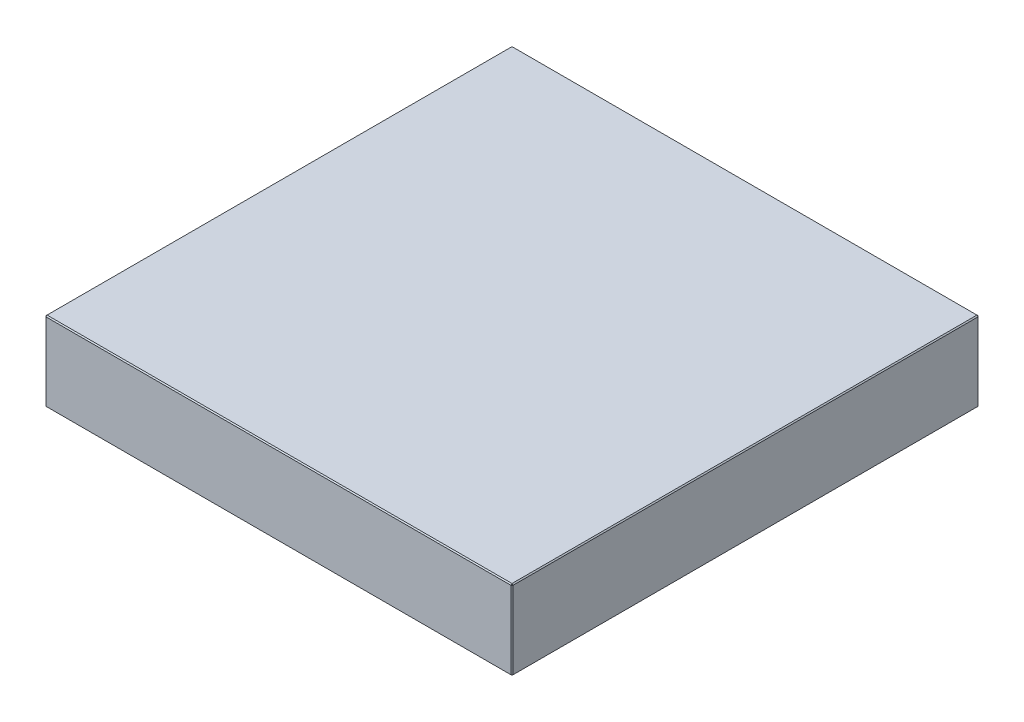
ISO-10303-21;
HEADER;
FILE_DESCRIPTION(('STEP AP214'),'2;1');
FILE_NAME('part.step','',(''),(''),'','','');
FILE_SCHEMA(('AUTOMOTIVE_DESIGN { 1 0 10303 214 1 1 1 1 }'));
ENDSEC;
DATA;
#1=APPLICATION_CONTEXT('core data for automotive mechanical design processes');
#2=APPLICATION_PROTOCOL_DEFINITION('international standard','automotive_design',2000,#1);
#3=PRODUCT_CONTEXT('',#1,'mechanical');
#4=PRODUCT('Part','Part','',(#3));
#5=PRODUCT_RELATED_PRODUCT_CATEGORY('part','',(#4));
#6=PRODUCT_DEFINITION_FORMATION('','',#4);
#7=PRODUCT_DEFINITION_CONTEXT('part definition',#1,'design');
#8=PRODUCT_DEFINITION('design','',#6,#7);
#9=PRODUCT_DEFINITION_SHAPE('','',#8);
#10=(LENGTH_UNIT() NAMED_UNIT(*) SI_UNIT(.MILLI.,.METRE.));
#11=(NAMED_UNIT(*) PLANE_ANGLE_UNIT() SI_UNIT($,.RADIAN.));
#12=(NAMED_UNIT(*) SI_UNIT($,.STERADIAN.) SOLID_ANGLE_UNIT());
#13=UNCERTAINTY_MEASURE_WITH_UNIT(LENGTH_MEASURE(1.E-05),#10,'distance_accuracy_value','');
#14=(GEOMETRIC_REPRESENTATION_CONTEXT(3) GLOBAL_UNCERTAINTY_ASSIGNED_CONTEXT((#13)) GLOBAL_UNIT_ASSIGNED_CONTEXT((#10,
#11,#12)) REPRESENTATION_CONTEXT('',''));
#15=CARTESIAN_POINT('',(0.,0.,0.));
#16=DIRECTION('',(0.,0.,1.));
#17=DIRECTION('',(1.,0.,0.));
#18=AXIS2_PLACEMENT_3D('',#15,#16,#17);
#19=CARTESIAN_POINT('',(-223.,76.,223.));
#20=DIRECTION('',(1.,0.,0.));
#21=DIRECTION('',(0.,0.,-1.));
#22=AXIS2_PLACEMENT_3D('',#19,#20,#21);
#23=PLANE('',#22);
#24=DIRECTION('',(0.,-1.,0.));
#25=VECTOR('',#24,1.);
#26=CARTESIAN_POINT('',(-223.,76.,-222.));
#27=LINE('',#26,#25);
#28=CARTESIAN_POINT('',(-223.,75.,-222.));
#29=VERTEX_POINT('',#28);
#30=CARTESIAN_POINT('',(-223.,1.,-222.));
#31=VERTEX_POINT('',#30);
#32=EDGE_CURVE('E114',#29,#31,#27,.T.);
#33=ORIENTED_EDGE('',*,*,#32,.T.);
#34=DIRECTION('',(0.,0.,1.));
#35=VECTOR('',#34,1.);
#36=CARTESIAN_POINT('',(-223.,1.,223.));
#37=LINE('',#36,#35);
#38=CARTESIAN_POINT('',(-223.,1.,222.));
#39=VERTEX_POINT('',#38);
#40=EDGE_CURVE('E110',#31,#39,#37,.T.);
#41=ORIENTED_EDGE('',*,*,#40,.T.);
#42=DIRECTION('',(0.,1.,0.));
#43=VECTOR('',#42,1.);
#44=CARTESIAN_POINT('',(-223.,76.,222.));
#45=LINE('',#44,#43);
#46=CARTESIAN_POINT('',(-223.,75.,222.));
#47=VERTEX_POINT('',#46);
#48=EDGE_CURVE('E103',#39,#47,#45,.T.);
#49=ORIENTED_EDGE('',*,*,#48,.T.);
#50=DIRECTION('',(0.,0.,-1.));
#51=VECTOR('',#50,1.);
#52=CARTESIAN_POINT('',(-223.,75.,-223.));
#53=LINE('',#52,#51);
#54=EDGE_CURVE('E107',#47,#29,#53,.T.);
#55=ORIENTED_EDGE('',*,*,#54,.T.);
#56=EDGE_LOOP('',(#33,#41,#49,#55));
#57=FACE_BOUND('',#56,.T.);
#58=ADVANCED_FACE('F15',(#57),#23,.F.);
#59=CARTESIAN_POINT('',(223.,76.,223.));
#60=DIRECTION('',(0.,0.,-1.));
#61=DIRECTION('',(-1.,0.,0.));
#62=AXIS2_PLACEMENT_3D('',#59,#60,#61);
#63=PLANE('',#62);
#64=DIRECTION('',(-1.,0.,0.));
#65=VECTOR('',#64,1.);
#66=CARTESIAN_POINT('',(-223.,75.,223.));
#67=LINE('',#66,#65);
#68=CARTESIAN_POINT('',(222.,75.,223.));
#69=VERTEX_POINT('',#68);
#70=CARTESIAN_POINT('',(-222.,75.,223.));
#71=VERTEX_POINT('',#70);
#72=EDGE_CURVE('E164',#69,#71,#67,.T.);
#73=ORIENTED_EDGE('',*,*,#72,.T.);
#74=DIRECTION('',(0.,-1.,0.));
#75=VECTOR('',#74,1.);
#76=CARTESIAN_POINT('',(-222.,76.,223.));
#77=LINE('',#76,#75);
#78=CARTESIAN_POINT('',(-222.,1.00000000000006,223.));
#79=VERTEX_POINT('',#78);
#80=EDGE_CURVE('E122',#71,#79,#77,.T.);
#81=ORIENTED_EDGE('',*,*,#80,.T.);
#82=DIRECTION('',(1.,0.,0.));
#83=VECTOR('',#82,1.);
#84=CARTESIAN_POINT('',(223.,1.00000000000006,223.));
#85=LINE('',#84,#83);
#86=CARTESIAN_POINT('',(222.,1.00000000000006,223.));
#87=VERTEX_POINT('',#86);
#88=EDGE_CURVE('E168',#79,#87,#85,.T.);
#89=ORIENTED_EDGE('',*,*,#88,.T.);
#90=DIRECTION('',(0.,1.,0.));
#91=VECTOR('',#90,1.);
#92=CARTESIAN_POINT('',(222.,76.,223.));
#93=LINE('',#92,#91);
#94=EDGE_CURVE('E166',#87,#69,#93,.T.);
#95=ORIENTED_EDGE('',*,*,#94,.T.);
#96=EDGE_LOOP('',(#73,#81,#89,#95));
#97=FACE_BOUND('',#96,.T.);
#98=ADVANCED_FACE('F275',(#97),#63,.F.);
#99=CARTESIAN_POINT('',(223.,76.,223.));
#100=DIRECTION('',(-1.,0.,0.));
#101=DIRECTION('',(0.,0.,1.));
#102=AXIS2_PLACEMENT_3D('',#99,#100,#101);
#103=PLANE('',#102);
#104=DIRECTION('',(0.,0.,-1.));
#105=VECTOR('',#104,1.);
#106=CARTESIAN_POINT('',(223.,1.00000000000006,223.));
#107=LINE('',#106,#105);
#108=CARTESIAN_POINT('',(223.,1.00000000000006,222.));
#109=VERTEX_POINT('',#108);
#110=CARTESIAN_POINT('',(223.,1.00000000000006,-222.));
#111=VERTEX_POINT('',#110);
#112=EDGE_CURVE('E159',#109,#111,#107,.T.);
#113=ORIENTED_EDGE('',*,*,#112,.T.);
#114=DIRECTION('',(0.,1.,0.));
#115=VECTOR('',#114,1.);
#116=CARTESIAN_POINT('',(223.,76.,-222.));
#117=LINE('',#116,#115);
#118=CARTESIAN_POINT('',(223.,75.,-222.));
#119=VERTEX_POINT('',#118);
#120=EDGE_CURVE('E161',#111,#119,#117,.T.);
#121=ORIENTED_EDGE('',*,*,#120,.T.);
#122=DIRECTION('',(0.,0.,1.));
#123=VECTOR('',#122,1.);
#124=CARTESIAN_POINT('',(223.,75.,223.));
#125=LINE('',#124,#123);
#126=CARTESIAN_POINT('',(223.,75.,222.));
#127=VERTEX_POINT('',#126);
#128=EDGE_CURVE('E155',#119,#127,#125,.T.);
#129=ORIENTED_EDGE('',*,*,#128,.T.);
#130=DIRECTION('',(0.,-1.,0.));
#131=VECTOR('',#130,1.);
#132=CARTESIAN_POINT('',(223.,76.,222.));
#133=LINE('',#132,#131);
#134=EDGE_CURVE('E157',#127,#109,#133,.T.);
#135=ORIENTED_EDGE('',*,*,#134,.T.);
#136=EDGE_LOOP('',(#113,#121,#129,#135));
#137=FACE_BOUND('',#136,.T.);
#138=ADVANCED_FACE('F254',(#137),#103,.F.);
#139=CARTESIAN_POINT('',(223.,76.,-223.));
#140=DIRECTION('',(0.,0.,1.));
#141=DIRECTION('',(1.,0.,0.));
#142=AXIS2_PLACEMENT_3D('',#139,#140,#141);
#143=PLANE('',#142);
#144=DIRECTION('',(0.,-1.,0.));
#145=VECTOR('',#144,1.);
#146=CARTESIAN_POINT('',(222.,76.,-223.));
#147=LINE('',#146,#145);
#148=CARTESIAN_POINT('',(222.,75.,-223.));
#149=VERTEX_POINT('',#148);
#150=CARTESIAN_POINT('',(222.,1.00000000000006,-223.));
#151=VERTEX_POINT('',#150);
#152=EDGE_CURVE('E148',#149,#151,#147,.T.);
#153=ORIENTED_EDGE('',*,*,#152,.T.);
#154=DIRECTION('',(-1.,0.,0.));
#155=VECTOR('',#154,1.);
#156=CARTESIAN_POINT('',(223.,1.00000000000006,-223.));
#157=LINE('',#156,#155);
#158=CARTESIAN_POINT('',(-222.,1.00000000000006,-223.));
#159=VERTEX_POINT('',#158);
#160=EDGE_CURVE('E153',#151,#159,#157,.T.);
#161=ORIENTED_EDGE('',*,*,#160,.T.);
#162=DIRECTION('',(0.,1.,0.));
#163=VECTOR('',#162,1.);
#164=CARTESIAN_POINT('',(-222.,76.,-223.));
#165=LINE('',#164,#163);
#166=CARTESIAN_POINT('',(-222.,75.,-223.));
#167=VERTEX_POINT('',#166);
#168=EDGE_CURVE('E150',#159,#167,#165,.T.);
#169=ORIENTED_EDGE('',*,*,#168,.T.);
#170=DIRECTION('',(1.,0.,0.));
#171=VECTOR('',#170,1.);
#172=CARTESIAN_POINT('',(223.,75.,-223.));
#173=LINE('',#172,#171);
#174=EDGE_CURVE('E146',#167,#149,#173,.T.);
#175=ORIENTED_EDGE('',*,*,#174,.T.);
#176=EDGE_LOOP('',(#153,#161,#169,#175));
#177=FACE_BOUND('',#176,.T.);
#178=ADVANCED_FACE('F284',(#177),#143,.F.);
#179=CARTESIAN_POINT('',(0.,76.,0.));
#180=DIRECTION('',(0.,1.,0.));
#181=DIRECTION('',(0.,0.,1.));
#182=AXIS2_PLACEMENT_3D('',#179,#180,#181);
#183=PLANE('',#182);
#184=DIRECTION('',(0.,0.,-1.));
#185=VECTOR('',#184,1.);
#186=CARTESIAN_POINT('',(222.,76.,-223.));
#187=LINE('',#186,#185);
#188=CARTESIAN_POINT('',(222.,76.,222.));
#189=VERTEX_POINT('',#188);
#190=CARTESIAN_POINT('',(222.,76.,-222.));
#191=VERTEX_POINT('',#190);
#192=EDGE_CURVE('E24',#189,#191,#187,.T.);
#193=ORIENTED_EDGE('',*,*,#192,.T.);
#194=DIRECTION('',(-1.,0.,0.));
#195=VECTOR('',#194,1.);
#196=CARTESIAN_POINT('',(-223.,76.,-222.));
#197=LINE('',#196,#195);
#198=CARTESIAN_POINT('',(-222.,76.,-222.));
#199=VERTEX_POINT('',#198);
#200=EDGE_CURVE('E9',#191,#199,#197,.T.);
#201=ORIENTED_EDGE('',*,*,#200,.T.);
#202=DIRECTION('',(0.,0.,1.));
#203=VECTOR('',#202,1.);
#204=CARTESIAN_POINT('',(-222.,76.,223.));
#205=LINE('',#204,#203);
#206=CARTESIAN_POINT('',(-222.,76.,222.));
#207=VERTEX_POINT('',#206);
#208=EDGE_CURVE('E180',#199,#207,#205,.T.);
#209=ORIENTED_EDGE('',*,*,#208,.T.);
#210=DIRECTION('',(1.,0.,0.));
#211=VECTOR('',#210,1.);
#212=CARTESIAN_POINT('',(223.,76.,222.));
#213=LINE('',#212,#211);
#214=EDGE_CURVE('E35',#207,#189,#213,.T.);
#215=ORIENTED_EDGE('',*,*,#214,.T.);
#216=EDGE_LOOP('',(#193,#201,#209,#215));
#217=FACE_BOUND('',#216,.T.);
#218=ADVANCED_FACE('F350',(#217),#183,.T.);
#219=CARTESIAN_POINT('',(0.,0.,0.));
#220=DIRECTION('',(0.,1.,0.));
#221=DIRECTION('',(0.,0.,1.));
#222=AXIS2_PLACEMENT_3D('',#219,#220,#221);
#223=PLANE('',#222);
#224=DIRECTION('',(0.,0.,1.));
#225=VECTOR('',#224,1.);
#226=CARTESIAN_POINT('',(222.,0.,0.));
#227=LINE('',#226,#225);
#228=CARTESIAN_POINT('',(222.,0.,-222.));
#229=VERTEX_POINT('',#228);
#230=CARTESIAN_POINT('',(222.,0.,222.));
#231=VERTEX_POINT('',#230);
#232=EDGE_CURVE('E171',#229,#231,#227,.T.);
#233=ORIENTED_EDGE('',*,*,#232,.T.);
#234=DIRECTION('',(-1.,0.,0.));
#235=VECTOR('',#234,1.);
#236=CARTESIAN_POINT('',(0.,0.,222.));
#237=LINE('',#236,#235);
#238=CARTESIAN_POINT('',(-222.,0.,222.));
#239=VERTEX_POINT('',#238);
#240=EDGE_CURVE('E177',#231,#239,#237,.T.);
#241=ORIENTED_EDGE('',*,*,#240,.T.);
#242=DIRECTION('',(0.,0.,-1.));
#243=VECTOR('',#242,1.);
#244=CARTESIAN_POINT('',(-222.,0.,0.));
#245=LINE('',#244,#243);
#246=CARTESIAN_POINT('',(-222.,0.,-222.));
#247=VERTEX_POINT('',#246);
#248=EDGE_CURVE('E175',#239,#247,#245,.T.);
#249=ORIENTED_EDGE('',*,*,#248,.T.);
#250=DIRECTION('',(1.,0.,0.));
#251=VECTOR('',#250,1.);
#252=CARTESIAN_POINT('',(0.,0.,-222.));
#253=LINE('',#252,#251);
#254=EDGE_CURVE('E173',#247,#229,#253,.T.);
#255=ORIENTED_EDGE('',*,*,#254,.T.);
#256=EDGE_LOOP('',(#233,#241,#249,#255));
#257=FACE_BOUND('',#256,.T.);
#258=ADVANCED_FACE('F246',(#257),#223,.F.);
#259=CARTESIAN_POINT('',(223.,76.,222.));
#260=DIRECTION('',(-0.707106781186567,0.,-0.707106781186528));
#261=DIRECTION('',(0.,-1.,0.));
#262=AXIS2_PLACEMENT_3D('',#259,#260,#261);
#263=PLANE('',#262);
#264=DIRECTION('',(-0.707106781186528,0.,0.707106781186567));
#265=VECTOR('',#264,1.);
#266=CARTESIAN_POINT('',(222.,75.,223.));
#267=LINE('',#266,#265);
#268=EDGE_CURVE('E19',#69,#127,#267,.F.);
#269=ORIENTED_EDGE('',*,*,#268,.F.);
#270=ORIENTED_EDGE('',*,*,#94,.F.);
#271=DIRECTION('',(0.707106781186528,0.,-0.707106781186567));
#272=VECTOR('',#271,1.);
#273=CARTESIAN_POINT('',(222.,1.00000000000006,223.));
#274=LINE('',#273,#272);
#275=EDGE_CURVE('E142',#109,#87,#274,.F.);
#276=ORIENTED_EDGE('',*,*,#275,.F.);
#277=ORIENTED_EDGE('',*,*,#134,.F.);
#278=EDGE_LOOP('',(#269,#270,#276,#277));
#279=FACE_BOUND('',#278,.T.);
#280=ADVANCED_FACE('F17',(#279),#263,.F.);
#281=CARTESIAN_POINT('',(222.,75.,223.));
#282=DIRECTION('',(0.577350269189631,0.577350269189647,0.577350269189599));
#283=DIRECTION('',(-0.707106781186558,0.707106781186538,0.));
#284=AXIS2_PLACEMENT_3D('',#281,#282,#283);
#285=PLANE('',#284);
#286=DIRECTION('',(0.,-0.707106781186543,0.707106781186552));
#287=VECTOR('',#286,1.);
#288=CARTESIAN_POINT('',(222.,75.,223.));
#289=LINE('',#288,#287);
#290=EDGE_CURVE('E226',#69,#189,#289,.F.);
#291=ORIENTED_EDGE('',*,*,#290,.F.);
#292=ORIENTED_EDGE('',*,*,#268,.T.);
#293=DIRECTION('',(-0.707106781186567,0.707106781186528,0.));
#294=VECTOR('',#293,1.);
#295=CARTESIAN_POINT('',(222.5,75.5,222.));
#296=LINE('',#295,#294);
#297=EDGE_CURVE('E228',#189,#127,#296,.F.);
#298=ORIENTED_EDGE('',*,*,#297,.F.);
#299=EDGE_LOOP('',(#291,#292,#298));
#300=FACE_BOUND('',#299,.T.);
#301=ADVANCED_FACE('F270',(#300),#285,.T.);
#302=CARTESIAN_POINT('',(222.,1.00000000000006,223.));
#303=DIRECTION('',(0.577350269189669,-0.577350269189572,0.577350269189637));
#304=DIRECTION('',(0.707106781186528,0.,-0.707106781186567));
#305=AXIS2_PLACEMENT_3D('',#302,#303,#304);
#306=PLANE('',#305);
#307=DIRECTION('',(-0.707106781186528,-0.707106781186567,0.));
#308=VECTOR('',#307,1.);
#309=CARTESIAN_POINT('',(222.5,0.5,222.));
#310=LINE('',#309,#308);
#311=EDGE_CURVE('E220',#109,#231,#310,.T.);
#312=ORIENTED_EDGE('',*,*,#311,.F.);
#313=ORIENTED_EDGE('',*,*,#275,.T.);
#314=DIRECTION('',(0.,0.707106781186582,0.707106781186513));
#315=VECTOR('',#314,1.);
#316=CARTESIAN_POINT('',(222.,1.00000000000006,223.));
#317=LINE('',#316,#315);
#318=EDGE_CURVE('E223',#231,#87,#317,.T.);
#319=ORIENTED_EDGE('',*,*,#318,.F.);
#320=EDGE_LOOP('',(#312,#313,#319));
#321=FACE_BOUND('',#320,.T.);
#322=ADVANCED_FACE('F235',(#321),#306,.T.);
#323=CARTESIAN_POINT('',(222.,76.,0.));
#324=DIRECTION('',(0.707106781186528,0.707106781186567,0.));
#325=DIRECTION('',(0.,0.,1.));
#326=AXIS2_PLACEMENT_3D('',#323,#324,#325);
#327=PLANE('',#326);
#328=ORIENTED_EDGE('',*,*,#297,.T.);
#329=ORIENTED_EDGE('',*,*,#128,.F.);
#330=DIRECTION('',(0.707106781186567,-0.707106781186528,0.));
#331=VECTOR('',#330,1.);
#332=CARTESIAN_POINT('',(223.,75.,-222.));
#333=LINE('',#332,#331);
#334=EDGE_CURVE('E215',#191,#119,#333,.T.);
#335=ORIENTED_EDGE('',*,*,#334,.F.);
#336=ORIENTED_EDGE('',*,*,#192,.F.);
#337=EDGE_LOOP('',(#328,#329,#335,#336));
#338=FACE_BOUND('',#337,.T.);
#339=ADVANCED_FACE('F265',(#338),#327,.T.);
#340=CARTESIAN_POINT('',(0.,76.,222.));
#341=DIRECTION('',(0.,0.707106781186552,0.707106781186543));
#342=DIRECTION('',(-1.,0.,0.));
#343=AXIS2_PLACEMENT_3D('',#340,#341,#342);
#344=PLANE('',#343);
#345=ORIENTED_EDGE('',*,*,#290,.T.);
#346=ORIENTED_EDGE('',*,*,#214,.F.);
#347=DIRECTION('',(0.,0.707106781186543,-0.707106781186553));
#348=VECTOR('',#347,1.);
#349=CARTESIAN_POINT('',(-222.,75.5,222.5));
#350=LINE('',#349,#348);
#351=EDGE_CURVE('E126',#71,#207,#350,.T.);
#352=ORIENTED_EDGE('',*,*,#351,.F.);
#353=ORIENTED_EDGE('',*,*,#72,.F.);
#354=EDGE_LOOP('',(#345,#346,#352,#353));
#355=FACE_BOUND('',#354,.T.);
#356=ADVANCED_FACE('F273',(#355),#344,.T.);
#357=CARTESIAN_POINT('',(-222.,76.,223.));
#358=DIRECTION('',(0.707106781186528,0.,-0.707106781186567));
#359=DIRECTION('',(0.,-1.,0.));
#360=AXIS2_PLACEMENT_3D('',#357,#358,#359);
#361=PLANE('',#360);
#362=DIRECTION('',(0.707106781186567,0.,0.707106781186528));
#363=VECTOR('',#362,1.);
#364=CARTESIAN_POINT('',(-222.,1.00000000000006,223.));
#365=LINE('',#364,#363);
#366=EDGE_CURVE('E127',#79,#39,#365,.F.);
#367=ORIENTED_EDGE('',*,*,#366,.F.);
#368=ORIENTED_EDGE('',*,*,#80,.F.);
#369=DIRECTION('',(-0.707106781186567,0.,-0.707106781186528));
#370=VECTOR('',#369,1.);
#371=CARTESIAN_POINT('',(-223.,75.,222.));
#372=LINE('',#371,#370);
#373=EDGE_CURVE('E118',#47,#71,#372,.F.);
#374=ORIENTED_EDGE('',*,*,#373,.F.);
#375=ORIENTED_EDGE('',*,*,#48,.F.);
#376=EDGE_LOOP('',(#367,#368,#374,#375));
#377=FACE_BOUND('',#376,.T.);
#378=ADVANCED_FACE('F120',(#377),#361,.F.);
#379=CARTESIAN_POINT('',(223.,1.00000000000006,223.));
#380=DIRECTION('',(0.,0.707106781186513,-0.707106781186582));
#381=DIRECTION('',(1.,0.,0.));
#382=AXIS2_PLACEMENT_3D('',#379,#380,#381);
#383=PLANE('',#382);
#384=ORIENTED_EDGE('',*,*,#318,.T.);
#385=ORIENTED_EDGE('',*,*,#88,.F.);
#386=DIRECTION('',(0.,-0.707106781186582,-0.707106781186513));
#387=VECTOR('',#386,1.);
#388=CARTESIAN_POINT('',(-222.,1.00000000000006,223.));
#389=LINE('',#388,#387);
#390=EDGE_CURVE('E211',#239,#79,#389,.F.);
#391=ORIENTED_EDGE('',*,*,#390,.F.);
#392=ORIENTED_EDGE('',*,*,#240,.F.);
#393=EDGE_LOOP('',(#384,#385,#391,#392));
#394=FACE_BOUND('',#393,.T.);
#395=ADVANCED_FACE('F243',(#394),#383,.F.);
#396=CARTESIAN_POINT('',(223.,1.00000000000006,223.));
#397=DIRECTION('',(-0.707106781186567,0.707106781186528,0.));
#398=DIRECTION('',(0.,0.,-1.));
#399=AXIS2_PLACEMENT_3D('',#396,#397,#398);
#400=PLANE('',#399);
#401=ORIENTED_EDGE('',*,*,#311,.T.);
#402=ORIENTED_EDGE('',*,*,#232,.F.);
#403=DIRECTION('',(0.707106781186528,0.707106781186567,0.));
#404=VECTOR('',#403,1.);
#405=CARTESIAN_POINT('',(222.5,0.500000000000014,-222.));
#406=LINE('',#405,#404);
#407=EDGE_CURVE('E208',#111,#229,#406,.F.);
#408=ORIENTED_EDGE('',*,*,#407,.F.);
#409=ORIENTED_EDGE('',*,*,#112,.F.);
#410=EDGE_LOOP('',(#401,#402,#408,#409));
#411=FACE_BOUND('',#410,.T.);
#412=ADVANCED_FACE('F251',(#411),#400,.F.);
#413=CARTESIAN_POINT('',(222.,76.,-223.));
#414=DIRECTION('',(-0.707106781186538,0.,0.707106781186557));
#415=DIRECTION('',(0.,-1.,0.));
#416=AXIS2_PLACEMENT_3D('',#413,#414,#415);
#417=PLANE('',#416);
#418=DIRECTION('',(0.707106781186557,0.,0.707106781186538));
#419=VECTOR('',#418,1.);
#420=CARTESIAN_POINT('',(223.,75.,-222.));
#421=LINE('',#420,#419);
#422=EDGE_CURVE('E217',#119,#149,#421,.F.);
#423=ORIENTED_EDGE('',*,*,#422,.F.);
#424=ORIENTED_EDGE('',*,*,#120,.F.);
#425=DIRECTION('',(-0.707106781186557,0.,-0.707106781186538));
#426=VECTOR('',#425,1.);
#427=CARTESIAN_POINT('',(222.,1.00000000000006,-223.));
#428=LINE('',#427,#426);
#429=EDGE_CURVE('E205',#151,#111,#428,.F.);
#430=ORIENTED_EDGE('',*,*,#429,.F.);
#431=ORIENTED_EDGE('',*,*,#152,.F.);
#432=EDGE_LOOP('',(#423,#424,#430,#431));
#433=FACE_BOUND('',#432,.T.);
#434=ADVANCED_FACE('F258',(#433),#417,.F.);
#435=CARTESIAN_POINT('',(223.,75.,-222.));
#436=DIRECTION('',(0.577350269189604,0.577350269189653,-0.57735026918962));
#437=DIRECTION('',(0.,0.707106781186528,0.707106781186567));
#438=AXIS2_PLACEMENT_3D('',#435,#436,#437);
#439=PLANE('',#438);
#440=ORIENTED_EDGE('',*,*,#334,.T.);
#441=ORIENTED_EDGE('',*,*,#422,.T.);
#442=DIRECTION('',(0.,0.707106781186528,0.707106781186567));
#443=VECTOR('',#442,1.);
#444=CARTESIAN_POINT('',(222.,75.5,-222.5));
#445=LINE('',#444,#443);
#446=EDGE_CURVE('E134',#191,#149,#445,.F.);
#447=ORIENTED_EDGE('',*,*,#446,.F.);
#448=EDGE_LOOP('',(#440,#441,#447));
#449=FACE_BOUND('',#448,.T.);
#450=ADVANCED_FACE('F325',(#449),#439,.T.);
#451=CARTESIAN_POINT('',(-223.,75.,222.));
#452=DIRECTION('',(-0.577350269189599,0.577350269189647,0.577350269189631));
#453=DIRECTION('',(0.,-0.707106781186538,0.707106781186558));
#454=AXIS2_PLACEMENT_3D('',#451,#452,#453);
#455=PLANE('',#454);
#456=ORIENTED_EDGE('',*,*,#373,.T.);
#457=ORIENTED_EDGE('',*,*,#351,.T.);
#458=DIRECTION('',(-0.707106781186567,-0.707106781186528,0.));
#459=VECTOR('',#458,1.);
#460=CARTESIAN_POINT('',(-223.,75.,222.));
#461=LINE('',#460,#459);
#462=EDGE_CURVE('E130',#47,#207,#461,.F.);
#463=ORIENTED_EDGE('',*,*,#462,.F.);
#464=EDGE_LOOP('',(#456,#457,#463));
#465=FACE_BOUND('',#464,.T.);
#466=ADVANCED_FACE('F131',(#465),#455,.T.);
#467=CARTESIAN_POINT('',(-222.,1.00000000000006,223.));
#468=DIRECTION('',(-0.577350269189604,-0.577350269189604,0.577350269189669));
#469=DIRECTION('',(0.707106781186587,0.,0.707106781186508));
#470=AXIS2_PLACEMENT_3D('',#467,#468,#469);
#471=PLANE('',#470);
#472=ORIENTED_EDGE('',*,*,#390,.T.);
#473=ORIENTED_EDGE('',*,*,#366,.T.);
#474=DIRECTION('',(-0.707106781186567,0.707106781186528,0.));
#475=VECTOR('',#474,1.);
#476=CARTESIAN_POINT('',(-222.5,0.499999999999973,222.));
#477=LINE('',#476,#475);
#478=EDGE_CURVE('E135',#239,#39,#477,.T.);
#479=ORIENTED_EDGE('',*,*,#478,.F.);
#480=EDGE_LOOP('',(#472,#473,#479));
#481=FACE_BOUND('',#480,.T.);
#482=ADVANCED_FACE('F318',(#481),#471,.T.);
#483=CARTESIAN_POINT('',(222.,1.00000000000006,-223.));
#484=DIRECTION('',(0.577350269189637,-0.577350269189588,-0.577350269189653));
#485=DIRECTION('',(-0.707106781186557,0.,-0.707106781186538));
#486=AXIS2_PLACEMENT_3D('',#483,#484,#485);
#487=PLANE('',#486);
#488=ORIENTED_EDGE('',*,*,#429,.T.);
#489=ORIENTED_EDGE('',*,*,#407,.T.);
#490=DIRECTION('',(0.,-0.707106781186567,0.707106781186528));
#491=VECTOR('',#490,1.);
#492=CARTESIAN_POINT('',(222.,1.00000000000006,-223.));
#493=LINE('',#492,#491);
#494=EDGE_CURVE('E198',#151,#229,#493,.T.);
#495=ORIENTED_EDGE('',*,*,#494,.F.);
#496=EDGE_LOOP('',(#488,#489,#495));
#497=FACE_BOUND('',#496,.T.);
#498=ADVANCED_FACE('F314',(#497),#487,.T.);
#499=CARTESIAN_POINT('',(0.,76.,-222.));
#500=DIRECTION('',(0.,0.707106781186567,-0.707106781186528));
#501=DIRECTION('',(1.,0.,0.));
#502=AXIS2_PLACEMENT_3D('',#499,#500,#501);
#503=PLANE('',#502);
#504=ORIENTED_EDGE('',*,*,#446,.T.);
#505=ORIENTED_EDGE('',*,*,#174,.F.);
#506=DIRECTION('',(0.,-0.707106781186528,-0.707106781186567));
#507=VECTOR('',#506,1.);
#508=CARTESIAN_POINT('',(-222.,75.,-223.));
#509=LINE('',#508,#507);
#510=EDGE_CURVE('E195',#199,#167,#509,.T.);
#511=ORIENTED_EDGE('',*,*,#510,.F.);
#512=ORIENTED_EDGE('',*,*,#200,.F.);
#513=EDGE_LOOP('',(#504,#505,#511,#512));
#514=FACE_BOUND('',#513,.T.);
#515=ADVANCED_FACE('F311',(#514),#503,.T.);
#516=CARTESIAN_POINT('',(-222.,76.,0.));
#517=DIRECTION('',(-0.707106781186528,0.707106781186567,0.));
#518=DIRECTION('',(0.,0.,-1.));
#519=AXIS2_PLACEMENT_3D('',#516,#517,#518);
#520=PLANE('',#519);
#521=ORIENTED_EDGE('',*,*,#462,.T.);
#522=ORIENTED_EDGE('',*,*,#208,.F.);
#523=DIRECTION('',(0.707106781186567,0.707106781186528,0.));
#524=VECTOR('',#523,1.);
#525=CARTESIAN_POINT('',(-222.5,75.5,-222.));
#526=LINE('',#525,#524);
#527=EDGE_CURVE('E138',#29,#199,#526,.T.);
#528=ORIENTED_EDGE('',*,*,#527,.F.);
#529=ORIENTED_EDGE('',*,*,#54,.F.);
#530=EDGE_LOOP('',(#521,#522,#528,#529));
#531=FACE_BOUND('',#530,.T.);
#532=ADVANCED_FACE('F137',(#531),#520,.T.);
#533=CARTESIAN_POINT('',(-223.,1.,223.));
#534=DIRECTION('',(0.707106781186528,0.707106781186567,0.));
#535=DIRECTION('',(0.,0.,1.));
#536=AXIS2_PLACEMENT_3D('',#533,#534,#535);
#537=PLANE('',#536);
#538=ORIENTED_EDGE('',*,*,#478,.T.);
#539=ORIENTED_EDGE('',*,*,#40,.F.);
#540=DIRECTION('',(0.707106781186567,-0.707106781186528,0.));
#541=VECTOR('',#540,1.);
#542=CARTESIAN_POINT('',(-223.,1.,-222.));
#543=LINE('',#542,#541);
#544=EDGE_CURVE('E191',#247,#31,#543,.F.);
#545=ORIENTED_EDGE('',*,*,#544,.F.);
#546=ORIENTED_EDGE('',*,*,#248,.F.);
#547=EDGE_LOOP('',(#538,#539,#545,#546));
#548=FACE_BOUND('',#547,.T.);
#549=ADVANCED_FACE('F304',(#548),#537,.F.);
#550=CARTESIAN_POINT('',(223.,1.00000000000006,-223.));
#551=DIRECTION('',(0.,0.707106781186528,0.707106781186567));
#552=DIRECTION('',(-1.,0.,0.));
#553=AXIS2_PLACEMENT_3D('',#550,#551,#552);
#554=PLANE('',#553);
#555=ORIENTED_EDGE('',*,*,#494,.T.);
#556=ORIENTED_EDGE('',*,*,#254,.F.);
#557=DIRECTION('',(0.,0.707106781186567,-0.707106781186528));
#558=VECTOR('',#557,1.);
#559=CARTESIAN_POINT('',(-222.,0.500000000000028,-222.5));
#560=LINE('',#559,#558);
#561=EDGE_CURVE('E188',#159,#247,#560,.F.);
#562=ORIENTED_EDGE('',*,*,#561,.F.);
#563=ORIENTED_EDGE('',*,*,#160,.F.);
#564=EDGE_LOOP('',(#555,#556,#562,#563));
#565=FACE_BOUND('',#564,.T.);
#566=ADVANCED_FACE('F300',(#565),#554,.F.);
#567=CARTESIAN_POINT('',(-222.,75.,-223.));
#568=DIRECTION('',(-0.577350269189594,0.577350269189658,-0.577350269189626));
#569=DIRECTION('',(0.,0.707106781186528,0.707106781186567));
#570=AXIS2_PLACEMENT_3D('',#567,#568,#569);
#571=PLANE('',#570);
#572=ORIENTED_EDGE('',*,*,#527,.T.);
#573=ORIENTED_EDGE('',*,*,#510,.T.);
#574=DIRECTION('',(0.707106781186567,0.,-0.707106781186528));
#575=VECTOR('',#574,1.);
#576=CARTESIAN_POINT('',(-222.,75.,-223.));
#577=LINE('',#576,#575);
#578=EDGE_CURVE('E186',#29,#167,#577,.T.);
#579=ORIENTED_EDGE('',*,*,#578,.F.);
#580=EDGE_LOOP('',(#572,#573,#579));
#581=FACE_BOUND('',#580,.T.);
#582=ADVANCED_FACE('F296',(#581),#571,.T.);
#583=CARTESIAN_POINT('',(-223.,1.,-222.));
#584=DIRECTION('',(-0.577350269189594,-0.577350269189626,-0.577350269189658));
#585=DIRECTION('',(0.,0.707106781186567,-0.707106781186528));
#586=AXIS2_PLACEMENT_3D('',#583,#584,#585);
#587=PLANE('',#586);
#588=ORIENTED_EDGE('',*,*,#561,.T.);
#589=ORIENTED_EDGE('',*,*,#544,.T.);
#590=DIRECTION('',(-0.707106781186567,0.,0.707106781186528));
#591=VECTOR('',#590,1.);
#592=CARTESIAN_POINT('',(-223.,1.,-222.));
#593=LINE('',#592,#591);
#594=EDGE_CURVE('E184',#159,#31,#593,.T.);
#595=ORIENTED_EDGE('',*,*,#594,.F.);
#596=EDGE_LOOP('',(#588,#589,#595));
#597=FACE_BOUND('',#596,.T.);
#598=ADVANCED_FACE('F292',(#597),#587,.T.);
#599=CARTESIAN_POINT('',(-223.,76.,-222.));
#600=DIRECTION('',(0.707106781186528,0.,0.707106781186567));
#601=DIRECTION('',(0.,-1.,0.));
#602=AXIS2_PLACEMENT_3D('',#599,#600,#601);
#603=PLANE('',#602);
#604=ORIENTED_EDGE('',*,*,#578,.T.);
#605=ORIENTED_EDGE('',*,*,#168,.F.);
#606=ORIENTED_EDGE('',*,*,#594,.T.);
#607=ORIENTED_EDGE('',*,*,#32,.F.);
#608=EDGE_LOOP('',(#604,#605,#606,#607));
#609=FACE_BOUND('',#608,.T.);
#610=ADVANCED_FACE('F289',(#609),#603,.F.);
#611=CLOSED_SHELL('',(#58,#98,#138,#178,#218,#258,#280,#301,#322,#339,#356,#378,#395,#412,#434,
#450,#466,#482,#498,#515,#532,#549,#566,#582,#598,#610));
#612=MANIFOLD_SOLID_BREP('B1',#611);
#613=ADVANCED_BREP_SHAPE_REPRESENTATION('',(#18,#612),#14);
#614=SHAPE_DEFINITION_REPRESENTATION(#9,#613);
ENDSEC;
END-ISO-10303-21;
